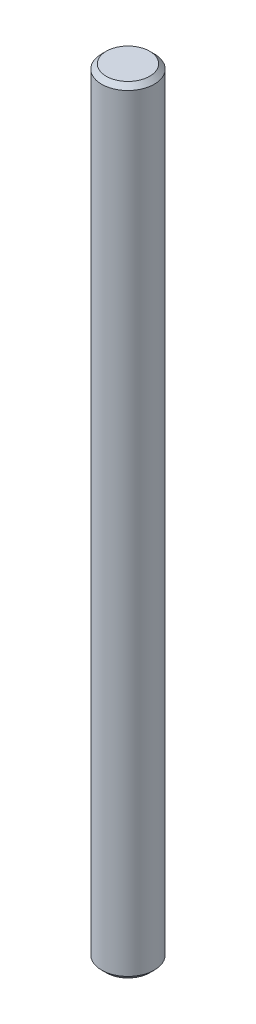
from build123d import *

# Parameters (mm, degrees)
SKETCH1_R      = 2
EXTRUDE1_DEPTH = 59
CHAMFER2_SIZE  = 0.35


with BuildPart() as part:
    # Sketch1 → Extrude1 (new body)
    with BuildSketch(Plane(origin=(0, 0, 0), x_dir=(1, 0, 0), z_dir=(0, 1, 0))):
        with Locations(Location((0, 0, 0), (0, 0, 270))):
            Circle(SKETCH1_R)
    extrude(amount=EXTRUDE1_DEPTH)

    # Chamfer2
    chamfer2_edges = [part.edges().sort_by_distance(p)[0] for p in [
        (0, 0, -2),
        (0, 59, -2),
    ]]
    chamfer(chamfer2_edges, length=CHAMFER2_SIZE)


solid = part.part
